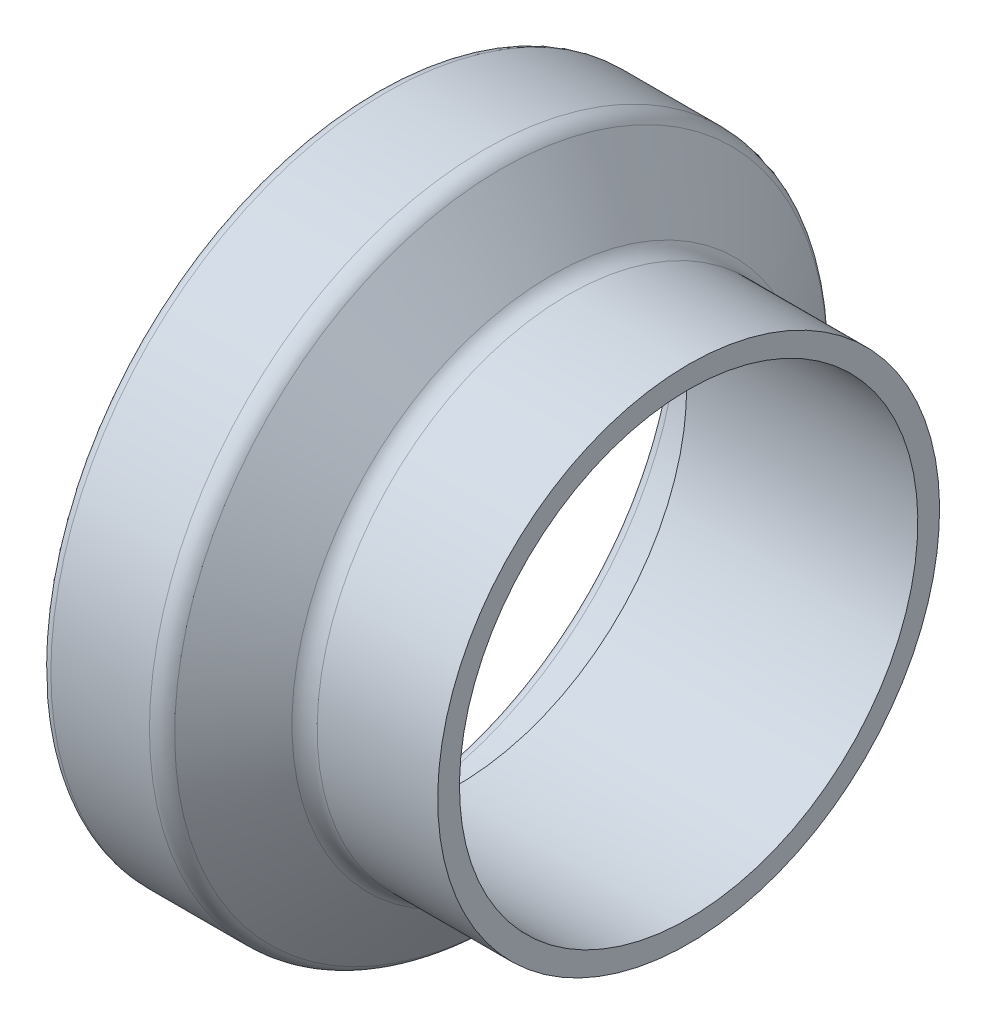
ISO-10303-21;
HEADER;
FILE_DESCRIPTION(('STEP AP214'),'2;1');
FILE_NAME('part.step','',(''),(''),'','','');
FILE_SCHEMA(('AUTOMOTIVE_DESIGN { 1 0 10303 214 1 1 1 1 }'));
ENDSEC;
DATA;
#1=APPLICATION_CONTEXT('core data for automotive mechanical design processes');
#2=APPLICATION_PROTOCOL_DEFINITION('international standard','automotive_design',2000,#1);
#3=PRODUCT_CONTEXT('',#1,'mechanical');
#4=PRODUCT('Part','Part','',(#3));
#5=PRODUCT_RELATED_PRODUCT_CATEGORY('part','',(#4));
#6=PRODUCT_DEFINITION_FORMATION('','',#4);
#7=PRODUCT_DEFINITION_CONTEXT('part definition',#1,'design');
#8=PRODUCT_DEFINITION('design','',#6,#7);
#9=PRODUCT_DEFINITION_SHAPE('','',#8);
#10=(LENGTH_UNIT() NAMED_UNIT(*) SI_UNIT(.MILLI.,.METRE.));
#11=(NAMED_UNIT(*) PLANE_ANGLE_UNIT() SI_UNIT($,.RADIAN.));
#12=(NAMED_UNIT(*) SI_UNIT($,.STERADIAN.) SOLID_ANGLE_UNIT());
#13=UNCERTAINTY_MEASURE_WITH_UNIT(LENGTH_MEASURE(1.E-05),#10,'distance_accuracy_value','');
#14=(GEOMETRIC_REPRESENTATION_CONTEXT(3) GLOBAL_UNCERTAINTY_ASSIGNED_CONTEXT((#13)) GLOBAL_UNIT_ASSIGNED_CONTEXT((#10,
#11,#12)) REPRESENTATION_CONTEXT('',''));
#15=CARTESIAN_POINT('',(0.,0.,0.));
#16=DIRECTION('',(0.,0.,1.));
#17=DIRECTION('',(1.,0.,0.));
#18=AXIS2_PLACEMENT_3D('',#15,#16,#17);
#19=CARTESIAN_POINT('',(-8.2305835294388,19.05,0.));
#20=DIRECTION('',(1.,0.,0.));
#21=DIRECTION('',(0.,1.,0.));
#22=AXIS2_PLACEMENT_3D('',#19,#20,#21);
#23=PLANE('',#22);
#24=CARTESIAN_POINT('',(-8.2305835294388,0.,0.));
#25=DIRECTION('',(1.,0.,0.));
#26=DIRECTION('',(0.,1.,0.));
#27=AXIS2_PLACEMENT_3D('',#24,#25,#26);
#28=CIRCLE('',#27,19.05);
#29=CARTESIAN_POINT('',(-8.2305835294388,19.05,0.));
#30=VERTEX_POINT('',#29);
#31=EDGE_CURVE('E74',#30,#30,#28,.T.);
#32=ORIENTED_EDGE('',*,*,#31,.T.);
#33=EDGE_LOOP('',(#32));
#34=FACE_BOUND('',#33,.T.);
#35=CARTESIAN_POINT('',(-8.2305835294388,0.,0.));
#36=DIRECTION('',(1.,0.,0.));
#37=DIRECTION('',(0.,1.,0.));
#38=AXIS2_PLACEMENT_3D('',#35,#36,#37);
#39=CIRCLE('',#38,17.399);
#40=CARTESIAN_POINT('',(-8.2305835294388,17.399,0.));
#41=VERTEX_POINT('',#40);
#42=EDGE_CURVE('E10',#41,#41,#39,.T.);
#43=ORIENTED_EDGE('',*,*,#42,.F.);
#44=EDGE_LOOP('',(#43));
#45=FACE_BOUND('',#44,.T.);
#46=ADVANCED_FACE('F31',(#34,#45),#23,.T.);
#47=CARTESIAN_POINT('',(0.,0.,0.));
#48=DIRECTION('',(1.,0.,0.));
#49=DIRECTION('',(0.,1.,0.));
#50=AXIS2_PLACEMENT_3D('',#47,#48,#49);
#51=CYLINDRICAL_SURFACE('',#50,17.399);
#52=ORIENTED_EDGE('',*,*,#42,.T.);
#53=EDGE_LOOP('',(#52));
#54=FACE_BOUND('',#53,.T.);
#55=CARTESIAN_POINT('',(-25.7819835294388,0.,0.));
#56=DIRECTION('',(1.,0.,0.));
#57=DIRECTION('',(0.,1.,0.));
#58=AXIS2_PLACEMENT_3D('',#55,#56,#57);
#59=CIRCLE('',#58,17.399);
#60=CARTESIAN_POINT('',(-25.7819835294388,17.399,0.));
#61=VERTEX_POINT('',#60);
#62=EDGE_CURVE('E37',#61,#61,#59,.T.);
#63=ORIENTED_EDGE('',*,*,#62,.F.);
#64=EDGE_LOOP('',(#63));
#65=FACE_BOUND('',#64,.T.);
#66=ADVANCED_FACE('F92',(#54,#65),#51,.F.);
#67=CARTESIAN_POINT('',(-25.7819835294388,17.399,0.));
#68=DIRECTION('',(-1.,0.,0.));
#69=DIRECTION('',(0.,-1.,0.));
#70=AXIS2_PLACEMENT_3D('',#67,#68,#69);
#71=PLANE('',#70);
#72=ORIENTED_EDGE('',*,*,#62,.T.);
#73=EDGE_LOOP('',(#72));
#74=FACE_BOUND('',#73,.T.);
#75=CARTESIAN_POINT('',(-25.7819835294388,0.,0.));
#76=DIRECTION('',(1.,0.,0.));
#77=DIRECTION('',(0.,1.,0.));
#78=AXIS2_PLACEMENT_3D('',#75,#76,#77);
#79=CIRCLE('',#78,21.4503);
#80=CARTESIAN_POINT('',(-25.7819835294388,21.4503,0.));
#81=VERTEX_POINT('',#80);
#82=EDGE_CURVE('E41',#81,#81,#79,.T.);
#83=ORIENTED_EDGE('',*,*,#82,.F.);
#84=EDGE_LOOP('',(#83));
#85=FACE_BOUND('',#84,.T.);
#86=ADVANCED_FACE('F96',(#74,#85),#71,.T.);
#87=CARTESIAN_POINT('',(-26.5947835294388,0.,0.));
#88=DIRECTION('',(1.,0.,0.));
#89=DIRECTION('',(0.,1.,0.));
#90=AXIS2_PLACEMENT_3D('',#87,#88,#89);
#91=TOROIDAL_SURFACE('',#90,21.4503,0.812800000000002);
#92=ORIENTED_EDGE('',*,*,#82,.T.);
#93=EDGE_LOOP('',(#92));
#94=FACE_BOUND('',#93,.T.);
#95=CARTESIAN_POINT('',(-26.5947835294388,0.,0.));
#96=DIRECTION('',(1.,0.,0.));
#97=DIRECTION('',(0.,1.,0.));
#98=AXIS2_PLACEMENT_3D('',#95,#96,#97);
#99=CIRCLE('',#98,22.2631);
#100=CARTESIAN_POINT('',(-26.5947835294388,22.2631,0.));
#101=VERTEX_POINT('',#100);
#102=EDGE_CURVE('E45',#101,#101,#99,.T.);
#103=ORIENTED_EDGE('',*,*,#102,.F.);
#104=EDGE_LOOP('',(#103));
#105=FACE_BOUND('',#104,.T.);
#106=ADVANCED_FACE('F100',(#94,#105),#91,.F.);
#107=CARTESIAN_POINT('',(0.,0.,0.));
#108=DIRECTION('',(1.,0.,0.));
#109=DIRECTION('',(0.,1.,0.));
#110=AXIS2_PLACEMENT_3D('',#107,#108,#109);
#111=CYLINDRICAL_SURFACE('',#110,22.2631);
#112=ORIENTED_EDGE('',*,*,#102,.T.);
#113=EDGE_LOOP('',(#112));
#114=FACE_BOUND('',#113,.T.);
#115=CARTESIAN_POINT('',(-31.2429835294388,0.,0.));
#116=DIRECTION('',(1.,0.,0.));
#117=DIRECTION('',(0.,1.,0.));
#118=AXIS2_PLACEMENT_3D('',#115,#116,#117);
#119=CIRCLE('',#118,22.2631);
#120=CARTESIAN_POINT('',(-31.2429835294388,22.2631,0.));
#121=VERTEX_POINT('',#120);
#122=EDGE_CURVE('E50',#121,#121,#119,.T.);
#123=ORIENTED_EDGE('',*,*,#122,.F.);
#124=EDGE_LOOP('',(#123));
#125=FACE_BOUND('',#124,.T.);
#126=ADVANCED_FACE('F106',(#114,#125),#111,.F.);
#127=CARTESIAN_POINT('',(-31.2429835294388,0.,0.));
#128=DIRECTION('',(1.,0.,0.));
#129=DIRECTION('',(0.,1.,0.));
#130=AXIS2_PLACEMENT_3D('',#127,#128,#129);
#131=TOROIDAL_SURFACE('',#130,23.0759,0.812800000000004);
#132=ORIENTED_EDGE('',*,*,#122,.T.);
#133=EDGE_LOOP('',(#132));
#134=FACE_BOUND('',#133,.T.);
#135=CARTESIAN_POINT('',(-32.0557835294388,0.,0.));
#136=DIRECTION('',(1.,0.,0.));
#137=DIRECTION('',(0.,1.,0.));
#138=AXIS2_PLACEMENT_3D('',#135,#136,#137);
#139=CIRCLE('',#138,23.0759);
#140=CARTESIAN_POINT('',(-32.0557835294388,23.0759,0.));
#141=VERTEX_POINT('',#140);
#142=EDGE_CURVE('E53',#141,#141,#139,.T.);
#143=ORIENTED_EDGE('',*,*,#142,.F.);
#144=EDGE_LOOP('',(#143));
#145=FACE_BOUND('',#144,.T.);
#146=ADVANCED_FACE('F110',(#134,#145),#131,.T.);
#147=CARTESIAN_POINT('',(-32.0557835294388,23.0759,0.));
#148=DIRECTION('',(-1.,0.,0.));
#149=DIRECTION('',(0.,-1.,0.));
#150=AXIS2_PLACEMENT_3D('',#147,#148,#149);
#151=PLANE('',#150);
#152=ORIENTED_EDGE('',*,*,#142,.T.);
#153=EDGE_LOOP('',(#152));
#154=FACE_BOUND('',#153,.T.);
#155=CARTESIAN_POINT('',(-32.0557835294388,0.,0.));
#156=DIRECTION('',(1.,0.,0.));
#157=DIRECTION('',(0.,1.,0.));
#158=AXIS2_PLACEMENT_3D('',#155,#156,#157);
#159=CIRCLE('',#158,24.5872);
#160=CARTESIAN_POINT('',(-32.0557835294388,24.5872,0.));
#161=VERTEX_POINT('',#160);
#162=EDGE_CURVE('E56',#161,#161,#159,.T.);
#163=ORIENTED_EDGE('',*,*,#162,.F.);
#164=EDGE_LOOP('',(#163));
#165=FACE_BOUND('',#164,.T.);
#166=ADVANCED_FACE('F114',(#154,#165),#151,.T.);
#167=CARTESIAN_POINT('',(-31.2429835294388,0.,0.));
#168=DIRECTION('',(1.,0.,0.));
#169=DIRECTION('',(0.,1.,0.));
#170=AXIS2_PLACEMENT_3D('',#167,#168,#169);
#171=TOROIDAL_SURFACE('',#170,24.5872,0.812799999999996);
#172=ORIENTED_EDGE('',*,*,#162,.T.);
#173=EDGE_LOOP('',(#172));
#174=FACE_BOUND('',#173,.T.);
#175=CARTESIAN_POINT('',(-31.2429835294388,0.,0.));
#176=DIRECTION('',(1.,0.,0.));
#177=DIRECTION('',(0.,1.,0.));
#178=AXIS2_PLACEMENT_3D('',#175,#176,#177);
#179=CIRCLE('',#178,25.4);
#180=CARTESIAN_POINT('',(-31.2429835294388,25.4,0.));
#181=VERTEX_POINT('',#180);
#182=EDGE_CURVE('E59',#181,#181,#179,.T.);
#183=ORIENTED_EDGE('',*,*,#182,.F.);
#184=EDGE_LOOP('',(#183));
#185=FACE_BOUND('',#184,.T.);
#186=ADVANCED_FACE('F118',(#174,#185),#171,.T.);
#187=CARTESIAN_POINT('',(0.,0.,0.));
#188=DIRECTION('',(1.,0.,0.));
#189=DIRECTION('',(0.,1.,0.));
#190=AXIS2_PLACEMENT_3D('',#187,#188,#189);
#191=CYLINDRICAL_SURFACE('',#190,25.4);
#192=ORIENTED_EDGE('',*,*,#182,.T.);
#193=EDGE_LOOP('',(#192));
#194=FACE_BOUND('',#193,.T.);
#195=CARTESIAN_POINT('',(-23.7604138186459,0.,0.));
#196=DIRECTION('',(1.,0.,0.));
#197=DIRECTION('',(0.,1.,0.));
#198=AXIS2_PLACEMENT_3D('',#195,#196,#197);
#199=CIRCLE('',#198,25.4);
#200=CARTESIAN_POINT('',(-23.7604138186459,25.4,0.));
#201=VERTEX_POINT('',#200);
#202=EDGE_CURVE('E62',#201,#201,#199,.T.);
#203=ORIENTED_EDGE('',*,*,#202,.F.);
#204=EDGE_LOOP('',(#203));
#205=FACE_BOUND('',#204,.T.);
#206=ADVANCED_FACE('F122',(#194,#205),#191,.T.);
#207=CARTESIAN_POINT('',(-23.7604138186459,0.,0.));
#208=DIRECTION('',(1.,0.,0.));
#209=DIRECTION('',(0.,1.,0.));
#210=AXIS2_PLACEMENT_3D('',#207,#208,#209);
#211=TOROIDAL_SURFACE('',#210,23.7998,1.6002);
#212=ORIENTED_EDGE('',*,*,#202,.T.);
#213=EDGE_LOOP('',(#212));
#214=FACE_BOUND('',#213,.T.);
#215=CARTESIAN_POINT('',(-22.4824372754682,0.,0.));
#216=DIRECTION('',(1.,0.,0.));
#217=DIRECTION('',(0.,1.,0.));
#218=AXIS2_PLACEMENT_3D('',#215,#216,#217);
#219=CIRCLE('',#218,24.7628244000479);
#220=CARTESIAN_POINT('',(-22.4824372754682,24.7628244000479,0.));
#221=VERTEX_POINT('',#220);
#222=EDGE_CURVE('E65',#221,#221,#219,.T.);
#223=ORIENTED_EDGE('',*,*,#222,.F.);
#224=EDGE_LOOP('',(#223));
#225=FACE_BOUND('',#224,.T.);
#226=ADVANCED_FACE('F126',(#214,#225),#211,.T.);
#227=CARTESIAN_POINT('',(-18.6576615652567,0.,0.));
#228=DIRECTION('',(-1.,0.,0.));
#229=DIRECTION('',(0.,-1.,0.));
#230=AXIS2_PLACEMENT_3D('',#227,#228,#229);
#231=CONICAL_SURFACE('',#230,19.6871755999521,0.925024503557);
#232=ORIENTED_EDGE('',*,*,#222,.T.);
#233=EDGE_LOOP('',(#232));
#234=FACE_BOUND('',#233,.T.);
#235=CARTESIAN_POINT('',(-18.6576615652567,0.,0.));
#236=DIRECTION('',(1.,0.,0.));
#237=DIRECTION('',(0.,1.,0.));
#238=AXIS2_PLACEMENT_3D('',#235,#236,#237);
#239=CIRCLE('',#238,19.6871755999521);
#240=CARTESIAN_POINT('',(-18.6576615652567,19.6871755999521,0.));
#241=VERTEX_POINT('',#240);
#242=EDGE_CURVE('E68',#241,#241,#239,.T.);
#243=ORIENTED_EDGE('',*,*,#242,.F.);
#244=EDGE_LOOP('',(#243));
#245=FACE_BOUND('',#244,.T.);
#246=ADVANCED_FACE('F88',(#234,#245),#231,.T.);
#247=CARTESIAN_POINT('',(-17.379685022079,0.,0.));
#248=DIRECTION('',(1.,0.,0.));
#249=DIRECTION('',(0.,1.,0.));
#250=AXIS2_PLACEMENT_3D('',#247,#248,#249);
#251=TOROIDAL_SURFACE('',#250,20.6502,1.6002);
#252=ORIENTED_EDGE('',*,*,#242,.T.);
#253=EDGE_LOOP('',(#252));
#254=FACE_BOUND('',#253,.T.);
#255=CARTESIAN_POINT('',(-17.379685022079,0.,0.));
#256=DIRECTION('',(1.,0.,0.));
#257=DIRECTION('',(0.,1.,0.));
#258=AXIS2_PLACEMENT_3D('',#255,#256,#257);
#259=CIRCLE('',#258,19.05);
#260=CARTESIAN_POINT('',(-17.379685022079,19.05,0.));
#261=VERTEX_POINT('',#260);
#262=EDGE_CURVE('E71',#261,#261,#259,.T.);
#263=ORIENTED_EDGE('',*,*,#262,.F.);
#264=EDGE_LOOP('',(#263));
#265=FACE_BOUND('',#264,.T.);
#266=ADVANCED_FACE('F82',(#254,#265),#251,.F.);
#267=CARTESIAN_POINT('',(0.,0.,0.));
#268=DIRECTION('',(1.,0.,0.));
#269=DIRECTION('',(0.,1.,0.));
#270=AXIS2_PLACEMENT_3D('',#267,#268,#269);
#271=CYLINDRICAL_SURFACE('',#270,19.05);
#272=ORIENTED_EDGE('',*,*,#262,.T.);
#273=EDGE_LOOP('',(#272));
#274=FACE_BOUND('',#273,.T.);
#275=ORIENTED_EDGE('',*,*,#31,.F.);
#276=EDGE_LOOP('',(#275));
#277=FACE_BOUND('',#276,.T.);
#278=ADVANCED_FACE('F80',(#274,#277),#271,.T.);
#279=CLOSED_SHELL('',(#46,#66,#86,#106,#126,#146,#166,#186,#206,#226,#246,#266,#278));
#280=MANIFOLD_SOLID_BREP('B2',#279);
#281=ADVANCED_BREP_SHAPE_REPRESENTATION('',(#18,#280),#14);
#282=SHAPE_DEFINITION_REPRESENTATION(#9,#281);
ENDSEC;
END-ISO-10303-21;
